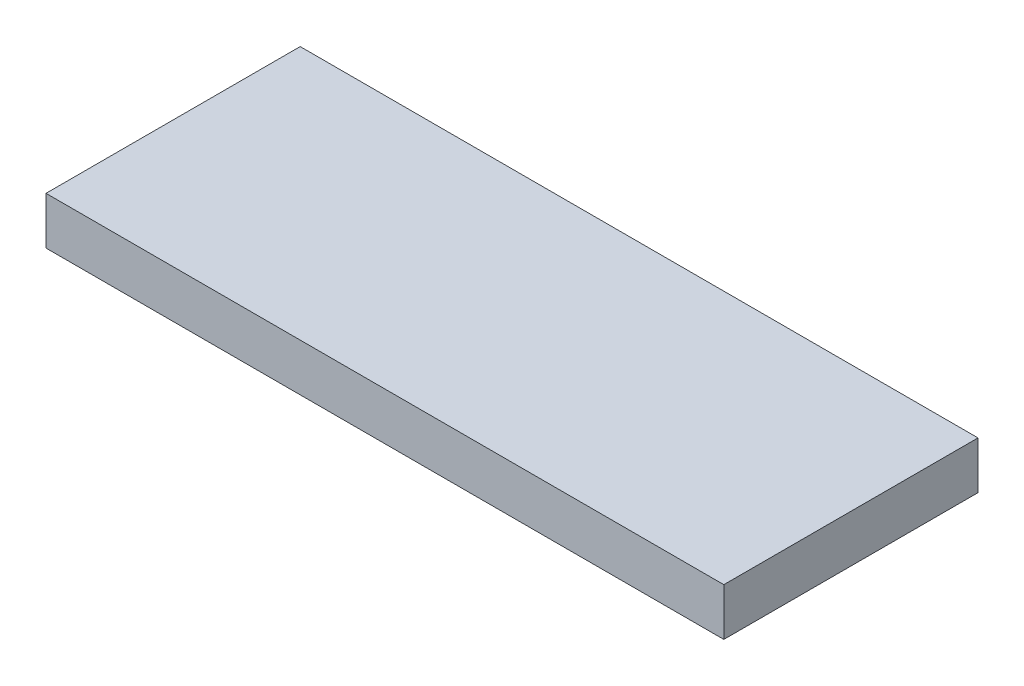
ISO-10303-21;
HEADER;
FILE_DESCRIPTION(('STEP AP214'),'2;1');
FILE_NAME('part.step','',(''),(''),'','','');
FILE_SCHEMA(('AUTOMOTIVE_DESIGN { 1 0 10303 214 1 1 1 1 }'));
ENDSEC;
DATA;
#1=APPLICATION_CONTEXT('core data for automotive mechanical design processes');
#2=APPLICATION_PROTOCOL_DEFINITION('international standard','automotive_design',2000,#1);
#3=PRODUCT_CONTEXT('',#1,'mechanical');
#4=PRODUCT('Part','Part','',(#3));
#5=PRODUCT_RELATED_PRODUCT_CATEGORY('part','',(#4));
#6=PRODUCT_DEFINITION_FORMATION('','',#4);
#7=PRODUCT_DEFINITION_CONTEXT('part definition',#1,'design');
#8=PRODUCT_DEFINITION('design','',#6,#7);
#9=PRODUCT_DEFINITION_SHAPE('','',#8);
#10=(LENGTH_UNIT() NAMED_UNIT(*) SI_UNIT(.MILLI.,.METRE.));
#11=(NAMED_UNIT(*) PLANE_ANGLE_UNIT() SI_UNIT($,.RADIAN.));
#12=(NAMED_UNIT(*) SI_UNIT($,.STERADIAN.) SOLID_ANGLE_UNIT());
#13=UNCERTAINTY_MEASURE_WITH_UNIT(LENGTH_MEASURE(1.E-05),#10,'distance_accuracy_value','');
#14=(GEOMETRIC_REPRESENTATION_CONTEXT(3) GLOBAL_UNCERTAINTY_ASSIGNED_CONTEXT((#13)) GLOBAL_UNIT_ASSIGNED_CONTEXT((#10,
#11,#12)) REPRESENTATION_CONTEXT('',''));
#15=CARTESIAN_POINT('',(0.,0.,0.));
#16=DIRECTION('',(0.,0.,1.));
#17=DIRECTION('',(1.,0.,0.));
#18=AXIS2_PLACEMENT_3D('',#15,#16,#17);
#19=CARTESIAN_POINT('',(0.,2.8,0.));
#20=DIRECTION('',(1.,0.,0.));
#21=DIRECTION('',(0.,0.,-1.));
#22=AXIS2_PLACEMENT_3D('',#19,#20,#21);
#23=PLANE('',#22);
#24=DIRECTION('',(0.,0.,1.));
#25=VECTOR('',#24,1.);
#26=CARTESIAN_POINT('',(0.,0.,0.));
#27=LINE('',#26,#25);
#28=CARTESIAN_POINT('',(0.,0.,-15.));
#29=VERTEX_POINT('',#28);
#30=CARTESIAN_POINT('',(0.,0.,0.));
#31=VERTEX_POINT('',#30);
#32=EDGE_CURVE('E96',#29,#31,#27,.T.);
#33=ORIENTED_EDGE('',*,*,#32,.T.);
#34=DIRECTION('',(0.,-1.,0.));
#35=VECTOR('',#34,1.);
#36=CARTESIAN_POINT('',(0.,2.8,0.));
#37=LINE('',#36,#35);
#38=CARTESIAN_POINT('',(0.,2.8,0.));
#39=VERTEX_POINT('',#38);
#40=EDGE_CURVE('E11',#39,#31,#37,.T.);
#41=ORIENTED_EDGE('',*,*,#40,.F.);
#42=DIRECTION('',(0.,0.,1.));
#43=VECTOR('',#42,1.);
#44=CARTESIAN_POINT('',(0.,2.8,0.));
#45=LINE('',#44,#43);
#46=CARTESIAN_POINT('',(0.,2.8,-15.));
#47=VERTEX_POINT('',#46);
#48=EDGE_CURVE('E84',#47,#39,#45,.T.);
#49=ORIENTED_EDGE('',*,*,#48,.F.);
#50=DIRECTION('',(0.,-1.,0.));
#51=VECTOR('',#50,1.);
#52=CARTESIAN_POINT('',(0.,2.8,-15.));
#53=LINE('',#52,#51);
#54=EDGE_CURVE('E92',#47,#29,#53,.T.);
#55=ORIENTED_EDGE('',*,*,#54,.T.);
#56=EDGE_LOOP('',(#33,#41,#49,#55));
#57=FACE_BOUND('',#56,.T.);
#58=ADVANCED_FACE('F33',(#57),#23,.F.);
#59=CARTESIAN_POINT('',(0.,2.8,0.));
#60=DIRECTION('',(0.,0.,-1.));
#61=DIRECTION('',(-1.,0.,0.));
#62=AXIS2_PLACEMENT_3D('',#59,#60,#61);
#63=PLANE('',#62);
#64=DIRECTION('',(1.,0.,0.));
#65=VECTOR('',#64,1.);
#66=CARTESIAN_POINT('',(0.,0.,0.));
#67=LINE('',#66,#65);
#68=CARTESIAN_POINT('',(40.,0.,0.));
#69=VERTEX_POINT('',#68);
#70=EDGE_CURVE('E88',#31,#69,#67,.T.);
#71=ORIENTED_EDGE('',*,*,#70,.T.);
#72=DIRECTION('',(0.,-1.,0.));
#73=VECTOR('',#72,1.);
#74=CARTESIAN_POINT('',(40.,2.8,0.));
#75=LINE('',#74,#73);
#76=CARTESIAN_POINT('',(40.,2.8,0.));
#77=VERTEX_POINT('',#76);
#78=EDGE_CURVE('E41',#77,#69,#75,.T.);
#79=ORIENTED_EDGE('',*,*,#78,.F.);
#80=DIRECTION('',(1.,0.,0.));
#81=VECTOR('',#80,1.);
#82=CARTESIAN_POINT('',(0.,2.8,0.));
#83=LINE('',#82,#81);
#84=EDGE_CURVE('E79',#39,#77,#83,.T.);
#85=ORIENTED_EDGE('',*,*,#84,.F.);
#86=ORIENTED_EDGE('',*,*,#40,.T.);
#87=EDGE_LOOP('',(#71,#79,#85,#86));
#88=FACE_BOUND('',#87,.T.);
#89=ADVANCED_FACE('F87',(#88),#63,.F.);
#90=CARTESIAN_POINT('',(40.,2.8,0.));
#91=DIRECTION('',(-1.,0.,0.));
#92=DIRECTION('',(0.,0.,1.));
#93=AXIS2_PLACEMENT_3D('',#90,#91,#92);
#94=PLANE('',#93);
#95=DIRECTION('',(0.,0.,-1.));
#96=VECTOR('',#95,1.);
#97=CARTESIAN_POINT('',(40.,0.,0.));
#98=LINE('',#97,#96);
#99=CARTESIAN_POINT('',(40.,0.,-15.));
#100=VERTEX_POINT('',#99);
#101=EDGE_CURVE('E66',#69,#100,#98,.T.);
#102=ORIENTED_EDGE('',*,*,#101,.T.);
#103=DIRECTION('',(0.,-1.,0.));
#104=VECTOR('',#103,1.);
#105=CARTESIAN_POINT('',(40.,2.8,-15.));
#106=LINE('',#105,#104);
#107=CARTESIAN_POINT('',(40.,2.8,-15.));
#108=VERTEX_POINT('',#107);
#109=EDGE_CURVE('E89',#108,#100,#106,.T.);
#110=ORIENTED_EDGE('',*,*,#109,.F.);
#111=DIRECTION('',(0.,0.,-1.));
#112=VECTOR('',#111,1.);
#113=CARTESIAN_POINT('',(40.,2.8,0.));
#114=LINE('',#113,#112);
#115=EDGE_CURVE('E82',#77,#108,#114,.T.);
#116=ORIENTED_EDGE('',*,*,#115,.F.);
#117=ORIENTED_EDGE('',*,*,#78,.T.);
#118=EDGE_LOOP('',(#102,#110,#116,#117));
#119=FACE_BOUND('',#118,.T.);
#120=ADVANCED_FACE('F90',(#119),#94,.F.);
#121=CARTESIAN_POINT('',(0.,2.8,-15.));
#122=DIRECTION('',(0.,0.,1.));
#123=DIRECTION('',(1.,0.,0.));
#124=AXIS2_PLACEMENT_3D('',#121,#122,#123);
#125=PLANE('',#124);
#126=DIRECTION('',(-1.,0.,0.));
#127=VECTOR('',#126,1.);
#128=CARTESIAN_POINT('',(0.,0.,-15.));
#129=LINE('',#128,#127);
#130=EDGE_CURVE('E72',#100,#29,#129,.T.);
#131=ORIENTED_EDGE('',*,*,#130,.T.);
#132=ORIENTED_EDGE('',*,*,#54,.F.);
#133=DIRECTION('',(-1.,0.,0.));
#134=VECTOR('',#133,1.);
#135=CARTESIAN_POINT('',(0.,2.8,-15.));
#136=LINE('',#135,#134);
#137=EDGE_CURVE('E49',#108,#47,#136,.T.);
#138=ORIENTED_EDGE('',*,*,#137,.F.);
#139=ORIENTED_EDGE('',*,*,#109,.T.);
#140=EDGE_LOOP('',(#131,#132,#138,#139));
#141=FACE_BOUND('',#140,.T.);
#142=ADVANCED_FACE('F103',(#141),#125,.F.);
#143=CARTESIAN_POINT('',(0.,2.8,0.));
#144=DIRECTION('',(0.,-1.,0.));
#145=DIRECTION('',(0.,0.,-1.));
#146=AXIS2_PLACEMENT_3D('',#143,#144,#145);
#147=PLANE('',#146);
#148=ORIENTED_EDGE('',*,*,#48,.T.);
#149=ORIENTED_EDGE('',*,*,#84,.T.);
#150=ORIENTED_EDGE('',*,*,#115,.T.);
#151=ORIENTED_EDGE('',*,*,#137,.T.);
#152=EDGE_LOOP('',(#148,#149,#150,#151));
#153=FACE_BOUND('',#152,.T.);
#154=ADVANCED_FACE('F80',(#153),#147,.F.);
#155=CARTESIAN_POINT('',(0.,0.,0.));
#156=DIRECTION('',(0.,-1.,0.));
#157=DIRECTION('',(0.,0.,-1.));
#158=AXIS2_PLACEMENT_3D('',#155,#156,#157);
#159=PLANE('',#158);
#160=ORIENTED_EDGE('',*,*,#32,.F.);
#161=ORIENTED_EDGE('',*,*,#130,.F.);
#162=ORIENTED_EDGE('',*,*,#101,.F.);
#163=ORIENTED_EDGE('',*,*,#70,.F.);
#164=EDGE_LOOP('',(#160,#161,#162,#163));
#165=FACE_BOUND('',#164,.T.);
#166=ADVANCED_FACE('F106',(#165),#159,.T.);
#167=CLOSED_SHELL('',(#58,#89,#120,#142,#154,#166));
#168=MANIFOLD_SOLID_BREP('B2',#167);
#169=ADVANCED_BREP_SHAPE_REPRESENTATION('',(#18,#168),#14);
#170=SHAPE_DEFINITION_REPRESENTATION(#9,#169);
ENDSEC;
END-ISO-10303-21;
